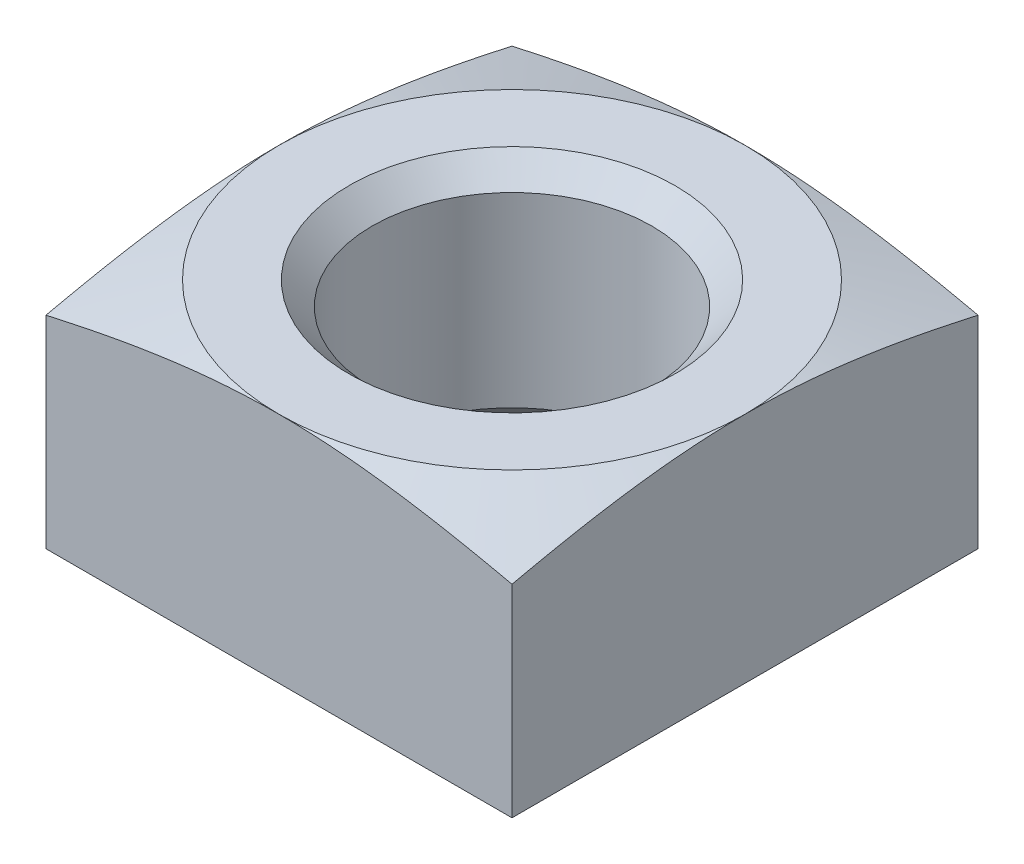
ISO-10303-21;
HEADER;
FILE_DESCRIPTION(('STEP AP214'),'2;1');
FILE_NAME('part.step','',(''),(''),'','','');
FILE_SCHEMA(('AUTOMOTIVE_DESIGN { 1 0 10303 214 1 1 1 1 }'));
ENDSEC;
DATA;
#1=APPLICATION_CONTEXT('core data for automotive mechanical design processes');
#2=APPLICATION_PROTOCOL_DEFINITION('international standard','automotive_design',2000,#1);
#3=PRODUCT_CONTEXT('',#1,'mechanical');
#4=PRODUCT('Part','Part','',(#3));
#5=PRODUCT_RELATED_PRODUCT_CATEGORY('part','',(#4));
#6=PRODUCT_DEFINITION_FORMATION('','',#4);
#7=PRODUCT_DEFINITION_CONTEXT('part definition',#1,'design');
#8=PRODUCT_DEFINITION('design','',#6,#7);
#9=PRODUCT_DEFINITION_SHAPE('','',#8);
#10=(LENGTH_UNIT() NAMED_UNIT(*) SI_UNIT(.MILLI.,.METRE.));
#11=(NAMED_UNIT(*) PLANE_ANGLE_UNIT() SI_UNIT($,.RADIAN.));
#12=(NAMED_UNIT(*) SI_UNIT($,.STERADIAN.) SOLID_ANGLE_UNIT());
#13=UNCERTAINTY_MEASURE_WITH_UNIT(LENGTH_MEASURE(1.E-05),#10,'distance_accuracy_value','');
#14=(GEOMETRIC_REPRESENTATION_CONTEXT(3) GLOBAL_UNCERTAINTY_ASSIGNED_CONTEXT((#13)) GLOBAL_UNIT_ASSIGNED_CONTEXT((#10,
#11,#12)) REPRESENTATION_CONTEXT('',''));
#15=CARTESIAN_POINT('',(0.,0.,0.));
#16=DIRECTION('',(0.,0.,1.));
#17=DIRECTION('',(1.,0.,0.));
#18=AXIS2_PLACEMENT_3D('',#15,#16,#17);
#19=CARTESIAN_POINT('',(5.,2.5,5.));
#20=DIRECTION('',(0.,0.,-1.));
#21=DIRECTION('',(-1.,0.,0.));
#22=AXIS2_PLACEMENT_3D('',#19,#20,#21);
#23=PLANE('',#22);
#24=DIRECTION('',(0.,-1.,0.));
#25=VECTOR('',#24,1.);
#26=CARTESIAN_POINT('',(5.,2.5,5.));
#27=LINE('',#26,#25);
#28=CARTESIAN_POINT('',(5.,1.8410238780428,5.));
#29=VERTEX_POINT('',#28);
#30=CARTESIAN_POINT('',(5.,-2.5,5.));
#31=VERTEX_POINT('',#30);
#32=EDGE_CURVE('E122',#29,#31,#27,.T.);
#33=ORIENTED_EDGE('',*,*,#32,.F.);
#34=CARTESIAN_POINT('',(-9.9547166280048,0.546409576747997,5.));
#35=CARTESIAN_POINT('',(-9.69691612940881,0.619697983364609,5.));
#36=CARTESIAN_POINT('',(-9.43896954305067,0.692477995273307,5.));
#37=CARTESIAN_POINT('',(-8.92270851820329,0.836743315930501,5.));
#38=CARTESIAN_POINT('',(-8.66439407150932,0.908228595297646,5.));
#39=CARTESIAN_POINT('',(-8.14742214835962,1.04959890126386,5.));
#40=CARTESIAN_POINT('',(-7.88876482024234,1.11948446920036,5.));
#41=CARTESIAN_POINT('',(-7.37092867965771,1.25729635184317,5.));
#42=CARTESIAN_POINT('',(-7.11174986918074,1.32522267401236,5.));
#43=CARTESIAN_POINT('',(-6.59474016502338,1.45810981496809,5.));
#44=CARTESIAN_POINT('',(-6.33691408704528,1.52308931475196,5.));
#45=CARTESIAN_POINT('',(-5.82051057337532,1.64998738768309,5.));
#46=CARTESIAN_POINT('',(-5.56193314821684,1.71190600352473,5.));
#47=CARTESIAN_POINT('',(-5.04364287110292,1.83189244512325,5.));
#48=CARTESIAN_POINT('',(-4.78392922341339,1.88995685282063,5.));
#49=CARTESIAN_POINT('',(-4.2634199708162,2.00106976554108,5.));
#50=CARTESIAN_POINT('',(-4.00262435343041,2.05411821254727,5.));
#51=CARTESIAN_POINT('',(-3.47502972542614,2.1546893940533,5.));
#52=CARTESIAN_POINT('',(-3.20820791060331,2.20209383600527,5.));
#53=CARTESIAN_POINT('',(-2.6731717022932,2.28839524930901,5.));
#54=CARTESIAN_POINT('',(-2.4049573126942,2.32729224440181,5.));
#55=CARTESIAN_POINT('',(-1.86768851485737,2.39444676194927,5.));
#56=CARTESIAN_POINT('',(-1.59863665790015,2.42272428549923,5.));
#57=CARTESIAN_POINT('',(-1.05950371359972,2.46678511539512,5.));
#58=CARTESIAN_POINT('',(-0.789422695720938,2.48256925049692,5.));
#59=CARTESIAN_POINT('',(-0.247248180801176,2.50037917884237,5.));
#60=CARTESIAN_POINT('',(0.0248479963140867,2.502325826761,5.));
#61=CARTESIAN_POINT('',(0.568770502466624,2.49207301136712,5.));
#62=CARTESIAN_POINT('',(0.840596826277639,2.4798732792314,5.));
#63=CARTESIAN_POINT('',(1.38381748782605,2.44235862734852,5.));
#64=CARTESIAN_POINT('',(1.6552101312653,2.41701980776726,5.));
#65=CARTESIAN_POINT('',(2.19668433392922,2.35509616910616,5.));
#66=CARTESIAN_POINT('',(2.46676586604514,2.31851111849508,5.));
#67=CARTESIAN_POINT('',(3.11363814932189,2.21971880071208,5.));
#68=CARTESIAN_POINT('',(3.48975036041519,2.15312127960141,5.));
#69=CARTESIAN_POINT('',(4.23953139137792,2.00722868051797,5.));
#70=CARTESIAN_POINT('',(4.61319959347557,1.92793051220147,5.));
#71=CARTESIAN_POINT('',(5.35881450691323,1.76040933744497,5.));
#72=CARTESIAN_POINT('',(5.73075964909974,1.67217942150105,5.));
#73=CARTESIAN_POINT('',(6.47306523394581,1.48948644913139,5.));
#74=CARTESIAN_POINT('',(6.8434258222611,1.39502397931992,5.));
#75=CARTESIAN_POINT('',(7.58394179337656,1.20137600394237,5.));
#76=CARTESIAN_POINT('',(7.95409409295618,1.10217876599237,5.));
#77=CARTESIAN_POINT('',(8.69350629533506,0.900497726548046,5.));
#78=CARTESIAN_POINT('',(9.06276618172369,0.798013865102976,5.));
#79=CARTESIAN_POINT('',(9.80041933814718,0.590642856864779,5.));
#80=CARTESIAN_POINT('',(10.1688129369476,0.485756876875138,5.));
#81=CARTESIAN_POINT('',(10.9050622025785,0.274111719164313,5.));
#82=CARTESIAN_POINT('',(11.272917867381,0.167352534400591,5.));
#83=CARTESIAN_POINT('',(12.3686425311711,-0.152973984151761,5.));
#84=CARTESIAN_POINT('',(13.0958968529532,-0.368642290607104,5.));
#85=CARTESIAN_POINT('',(14.5494426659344,-0.803569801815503,5.));
#86=CARTESIAN_POINT('',(15.2757340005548,-1.02282952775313,5.));
#87=CARTESIAN_POINT('',(16.7233709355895,-1.46247884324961,5.));
#88=CARTESIAN_POINT('',(17.4447207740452,-1.68285448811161,5.));
#89=CARTESIAN_POINT('',(18.5263018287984,-2.01465774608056,5.));
#90=CARTESIAN_POINT('',(18.8867262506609,-2.12545660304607,5.));
#91=CARTESIAN_POINT('',(19.6074636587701,-2.34741517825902,5.));
#92=CARTESIAN_POINT('',(19.9677766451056,-2.45857489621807,5.));
#93=CARTESIAN_POINT('',(20.3280428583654,-2.5698860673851,5.));
#94=B_SPLINE_CURVE_WITH_KNOTS('',3,(#34,#35,#36,#37,#38,#39,#40,#41,#42,#43,#44,#45,#46,#47,#48,
#49,#50,#51,#52,#53,#54,#55,#56,#57,#58,#59,#60,#61,#62,#63,#64,#65,#66,#67,#68,#69,#70,#71,#72,
#73,#74,#75,#76,#77,#78,#79,#80,#81,#82,#83,#84,#85,#86,#87,#88,#89,#90,#91,#92,#93),
.UNSPECIFIED.,.F.,.F.,(4,2,2,2,2,2,2,2,2,2,2,2,2,2,2,2,2,2,2,2,2,2,2,2,2,2,2,2,2,4),(0.,
0.804048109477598,1.60811444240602,2.41190453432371,3.21569156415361,4.01334208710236,
4.81098148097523,5.60931905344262,6.40766585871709,7.22055893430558,8.033449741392,
8.84480174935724,9.65609993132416,10.4720347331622,11.2879850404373,12.105424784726,
12.9228813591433,14.0684319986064,15.214261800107,16.3609848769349,17.5076001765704,
18.6572213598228,19.8068635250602,20.9559586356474,22.1050580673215,24.3807177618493,
26.6567106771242,28.9194931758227,30.0507045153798,31.1819149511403),.UNSPECIFIED.);
#95=CARTESIAN_POINT('',(0.,2.5,5.));
#96=VERTEX_POINT('',#95);
#97=EDGE_CURVE('E99',#29,#96,#94,.F.);
#98=ORIENTED_EDGE('',*,*,#97,.T.);
#99=CARTESIAN_POINT('',(-5.,1.8410238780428,5.));
#100=VERTEX_POINT('',#99);
#101=EDGE_CURVE('E112',#96,#100,#94,.F.);
#102=ORIENTED_EDGE('',*,*,#101,.T.);
#103=DIRECTION('',(0.,-1.,0.));
#104=VECTOR('',#103,1.);
#105=CARTESIAN_POINT('',(-5.,2.5,5.));
#106=LINE('',#105,#104);
#107=CARTESIAN_POINT('',(-5.,-2.5,5.));
#108=VERTEX_POINT('',#107);
#109=EDGE_CURVE('E184',#100,#108,#106,.T.);
#110=ORIENTED_EDGE('',*,*,#109,.T.);
#111=DIRECTION('',(-1.,0.,0.));
#112=VECTOR('',#111,1.);
#113=CARTESIAN_POINT('',(5.,-2.5,5.));
#114=LINE('',#113,#112);
#115=EDGE_CURVE('E193',#31,#108,#114,.T.);
#116=ORIENTED_EDGE('',*,*,#115,.F.);
#117=EDGE_LOOP('',(#33,#98,#102,#110,#116));
#118=FACE_BOUND('',#117,.T.);
#119=ADVANCED_FACE('F39',(#118),#23,.F.);
#120=CARTESIAN_POINT('',(5.,-2.5,-5.));
#121=DIRECTION('',(0.,1.,0.));
#122=DIRECTION('',(0.,0.,1.));
#123=AXIS2_PLACEMENT_3D('',#120,#121,#122);
#124=PLANE('',#123);
#125=CARTESIAN_POINT('',(0.,-2.5,0.));
#126=DIRECTION('',(0.,1.,0.));
#127=DIRECTION('',(0.,0.,1.));
#128=AXIS2_PLACEMENT_3D('',#125,#126,#127);
#129=CIRCLE('',#128,3.5);
#130=CARTESIAN_POINT('',(0.,-2.5,3.5));
#131=VERTEX_POINT('',#130);
#132=EDGE_CURVE('E11',#131,#131,#129,.T.);
#133=ORIENTED_EDGE('',*,*,#132,.T.);
#134=EDGE_LOOP('',(#133));
#135=FACE_BOUND('',#134,.T.);
#136=DIRECTION('',(0.,0.,-1.));
#137=VECTOR('',#136,1.);
#138=CARTESIAN_POINT('',(-5.,-2.5,-5.));
#139=LINE('',#138,#137);
#140=CARTESIAN_POINT('',(-5.,-2.5,-5.));
#141=VERTEX_POINT('',#140);
#142=EDGE_CURVE('E187',#108,#141,#139,.T.);
#143=ORIENTED_EDGE('',*,*,#142,.T.);
#144=DIRECTION('',(-1.,0.,0.));
#145=VECTOR('',#144,1.);
#146=CARTESIAN_POINT('',(5.,-2.5,-5.));
#147=LINE('',#146,#145);
#148=CARTESIAN_POINT('',(5.,-2.5,-5.));
#149=VERTEX_POINT('',#148);
#150=EDGE_CURVE('E183',#149,#141,#147,.T.);
#151=ORIENTED_EDGE('',*,*,#150,.F.);
#152=DIRECTION('',(0.,0.,-1.));
#153=VECTOR('',#152,1.);
#154=CARTESIAN_POINT('',(5.,-2.5,-5.));
#155=LINE('',#154,#153);
#156=EDGE_CURVE('E175',#31,#149,#155,.T.);
#157=ORIENTED_EDGE('',*,*,#156,.F.);
#158=ORIENTED_EDGE('',*,*,#115,.T.);
#159=EDGE_LOOP('',(#143,#151,#157,#158));
#160=FACE_BOUND('',#159,.T.);
#161=ADVANCED_FACE('F226',(#135,#160),#124,.F.);
#162=CARTESIAN_POINT('',(5.,2.5,-5.));
#163=DIRECTION('',(0.,0.,1.));
#164=DIRECTION('',(0.,-1.,0.));
#165=AXIS2_PLACEMENT_3D('',#162,#163,#164);
#166=PLANE('',#165);
#167=DIRECTION('',(0.,1.,0.));
#168=VECTOR('',#167,1.);
#169=CARTESIAN_POINT('',(-5.,2.5,-5.));
#170=LINE('',#169,#168);
#171=CARTESIAN_POINT('',(-5.,1.84102387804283,-5.00000000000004));
#172=VERTEX_POINT('',#171);
#173=EDGE_CURVE('E176',#141,#172,#170,.T.);
#174=ORIENTED_EDGE('',*,*,#173,.T.);
#175=CARTESIAN_POINT('',(-9.95471662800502,0.546409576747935,-5.));
#176=CARTESIAN_POINT('',(-9.69691612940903,0.619697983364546,-5.));
#177=CARTESIAN_POINT('',(-9.43896954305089,0.692477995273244,-5.));
#178=CARTESIAN_POINT('',(-8.92270851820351,0.836743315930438,-5.));
#179=CARTESIAN_POINT('',(-8.66439407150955,0.908228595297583,-5.));
#180=CARTESIAN_POINT('',(-8.14742214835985,1.04959890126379,-5.));
#181=CARTESIAN_POINT('',(-7.88876482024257,1.11948446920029,-5.));
#182=CARTESIAN_POINT('',(-7.37092867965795,1.2572963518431,-5.));
#183=CARTESIAN_POINT('',(-7.11174986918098,1.3252226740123,-5.));
#184=CARTESIAN_POINT('',(-6.59474016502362,1.45810981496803,-5.));
#185=CARTESIAN_POINT('',(-6.33691408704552,1.5230893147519,-5.));
#186=CARTESIAN_POINT('',(-5.82051057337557,1.64998738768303,-5.));
#187=CARTESIAN_POINT('',(-5.56193314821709,1.71190600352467,-5.));
#188=CARTESIAN_POINT('',(-5.04364287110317,1.83189244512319,-5.));
#189=CARTESIAN_POINT('',(-4.78392922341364,1.88995685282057,-5.));
#190=CARTESIAN_POINT('',(-4.26341997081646,2.00106976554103,-5.));
#191=CARTESIAN_POINT('',(-4.00262435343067,2.05411821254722,-5.));
#192=CARTESIAN_POINT('',(-3.4750297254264,2.15468939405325,-5.));
#193=CARTESIAN_POINT('',(-3.20820791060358,2.20209383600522,-5.));
#194=CARTESIAN_POINT('',(-2.67317170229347,2.28839524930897,-5.));
#195=CARTESIAN_POINT('',(-2.40495731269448,2.32729224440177,-5.));
#196=CARTESIAN_POINT('',(-1.86768851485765,2.39444676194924,-5.));
#197=CARTESIAN_POINT('',(-1.59863665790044,2.42272428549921,-5.));
#198=CARTESIAN_POINT('',(-1.05950371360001,2.4667851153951,-5.));
#199=CARTESIAN_POINT('',(-0.789422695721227,2.4825692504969,-5.));
#200=CARTESIAN_POINT('',(-0.24724818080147,2.50037917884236,-5.));
#201=CARTESIAN_POINT('',(0.0248479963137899,2.502325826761,-5.));
#202=CARTESIAN_POINT('',(0.568770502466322,2.49207301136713,-5.));
#203=CARTESIAN_POINT('',(0.840596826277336,2.47987327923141,-5.));
#204=CARTESIAN_POINT('',(1.38381748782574,2.44235862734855,-5.));
#205=CARTESIAN_POINT('',(1.65521013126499,2.41701980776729,-5.));
#206=CARTESIAN_POINT('',(2.1966843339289,2.3550961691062,-5.));
#207=CARTESIAN_POINT('',(2.46676586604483,2.31851111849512,-5.));
#208=CARTESIAN_POINT('',(3.11363814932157,2.21971880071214,-5.));
#209=CARTESIAN_POINT('',(3.48975036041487,2.15312127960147,-5.));
#210=CARTESIAN_POINT('',(4.2395313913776,2.00722868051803,-5.));
#211=CARTESIAN_POINT('',(4.61319959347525,1.92793051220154,-5.));
#212=CARTESIAN_POINT('',(5.35881450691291,1.76040933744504,-5.));
#213=CARTESIAN_POINT('',(5.73075964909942,1.67217942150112,-5.));
#214=CARTESIAN_POINT('',(6.47306523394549,1.48948644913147,-5.));
#215=CARTESIAN_POINT('',(6.84342582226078,1.39502397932,-5.));
#216=CARTESIAN_POINT('',(7.58394179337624,1.20137600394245,-5.));
#217=CARTESIAN_POINT('',(7.95409409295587,1.10217876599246,-5.));
#218=CARTESIAN_POINT('',(8.69350629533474,0.900497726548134,-5.));
#219=CARTESIAN_POINT('',(9.06276618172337,0.798013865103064,-5.));
#220=CARTESIAN_POINT('',(9.80041933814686,0.59064285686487,-5.));
#221=CARTESIAN_POINT('',(10.1688129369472,0.485756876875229,-5.));
#222=CARTESIAN_POINT('',(10.9050622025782,0.274111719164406,-5.));
#223=CARTESIAN_POINT('',(11.2729178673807,0.167352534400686,-5.));
#224=CARTESIAN_POINT('',(12.3686425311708,-0.152973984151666,-5.));
#225=CARTESIAN_POINT('',(13.0958968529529,-0.368642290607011,-5.));
#226=CARTESIAN_POINT('',(14.5494426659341,-0.803569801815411,-5.));
#227=CARTESIAN_POINT('',(15.2757340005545,-1.02282952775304,-5.));
#228=CARTESIAN_POINT('',(16.7233709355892,-1.46247884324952,-5.));
#229=CARTESIAN_POINT('',(17.4447207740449,-1.68285448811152,-5.));
#230=CARTESIAN_POINT('',(18.5263018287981,-2.01465774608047,-5.));
#231=CARTESIAN_POINT('',(18.8867262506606,-2.12545660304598,-5.));
#232=CARTESIAN_POINT('',(19.6074636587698,-2.34741517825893,-5.));
#233=CARTESIAN_POINT('',(19.9677766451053,-2.45857489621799,-5.));
#234=CARTESIAN_POINT('',(20.3280428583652,-2.56988606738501,-5.));
#235=B_SPLINE_CURVE_WITH_KNOTS('',3,(#175,#176,#177,#178,#179,#180,#181,#182,#183,#184,#185,
#186,#187,#188,#189,#190,#191,#192,#193,#194,#195,#196,#197,#198,#199,#200,#201,#202,#203,#204,
#205,#206,#207,#208,#209,#210,#211,#212,#213,#214,#215,#216,#217,#218,#219,#220,#221,#222,#223,
#224,#225,#226,#227,#228,#229,#230,#231,#232,#233,#234),.UNSPECIFIED.,.F.,.F.,(4,2,2,2,2,2,2,2,
2,2,2,2,2,2,2,2,2,2,2,2,2,2,2,2,2,2,2,2,2,4),(0.,0.804048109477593,1.60811444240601,
2.41190453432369,3.21569156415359,4.01334208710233,4.8109814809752,5.60931905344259,
6.40766585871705,7.22055893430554,8.03344974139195,8.84480174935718,9.65609993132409,
10.4720347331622,11.2879850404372,12.1054247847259,12.9228813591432,14.0684319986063,
15.2142618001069,16.3609848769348,17.5076001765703,18.6572213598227,19.8068635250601,
20.9559586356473,22.1050580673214,24.3807177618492,26.6567106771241,28.9194931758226,
30.0507045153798,31.1819149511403),.UNSPECIFIED.);
#236=CARTESIAN_POINT('',(0.,2.5,-5.));
#237=VERTEX_POINT('',#236);
#238=EDGE_CURVE('E62',#172,#237,#235,.T.);
#239=ORIENTED_EDGE('',*,*,#238,.T.);
#240=CARTESIAN_POINT('',(5.,1.84102387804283,-5.00000000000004));
#241=VERTEX_POINT('',#240);
#242=EDGE_CURVE('E137',#237,#241,#235,.T.);
#243=ORIENTED_EDGE('',*,*,#242,.T.);
#244=DIRECTION('',(0.,1.,0.));
#245=VECTOR('',#244,1.);
#246=CARTESIAN_POINT('',(5.,2.5,-5.));
#247=LINE('',#246,#245);
#248=EDGE_CURVE('E179',#149,#241,#247,.T.);
#249=ORIENTED_EDGE('',*,*,#248,.F.);
#250=ORIENTED_EDGE('',*,*,#150,.T.);
#251=EDGE_LOOP('',(#174,#239,#243,#249,#250));
#252=FACE_BOUND('',#251,.T.);
#253=ADVANCED_FACE('F143',(#252),#166,.F.);
#254=CARTESIAN_POINT('',(5.,0.,0.));
#255=DIRECTION('',(-1.,0.,0.));
#256=DIRECTION('',(0.,0.,1.));
#257=AXIS2_PLACEMENT_3D('',#254,#255,#256);
#258=PLANE('',#257);
#259=ORIENTED_EDGE('',*,*,#248,.T.);
#260=CARTESIAN_POINT('',(5.,0.546409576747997,-9.9547166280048));
#261=CARTESIAN_POINT('',(5.,0.619697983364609,-9.69691612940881));
#262=CARTESIAN_POINT('',(5.,0.692477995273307,-9.43896954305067));
#263=CARTESIAN_POINT('',(5.,0.836743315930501,-8.92270851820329));
#264=CARTESIAN_POINT('',(5.,0.908228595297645,-8.66439407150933));
#265=CARTESIAN_POINT('',(5.,1.04959890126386,-8.14742214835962));
#266=CARTESIAN_POINT('',(5.,1.11948446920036,-7.88876482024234));
#267=CARTESIAN_POINT('',(5.,1.25729635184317,-7.37092867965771));
#268=CARTESIAN_POINT('',(5.,1.32522267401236,-7.11174986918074));
#269=CARTESIAN_POINT('',(5.,1.45810981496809,-6.59474016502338));
#270=CARTESIAN_POINT('',(5.,1.52308931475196,-6.33691408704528));
#271=CARTESIAN_POINT('',(5.,1.64998738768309,-5.82051057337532));
#272=CARTESIAN_POINT('',(5.,1.71190600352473,-5.56193314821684));
#273=CARTESIAN_POINT('',(5.,1.83189244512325,-5.04364287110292));
#274=CARTESIAN_POINT('',(5.,1.88995685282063,-4.78392922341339));
#275=CARTESIAN_POINT('',(5.,2.00106976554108,-4.26341997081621));
#276=CARTESIAN_POINT('',(5.,2.05411821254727,-4.00262435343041));
#277=CARTESIAN_POINT('',(5.,2.1546893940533,-3.47502972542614));
#278=CARTESIAN_POINT('',(5.,2.20209383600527,-3.20820791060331));
#279=CARTESIAN_POINT('',(5.,2.28839524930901,-2.6731717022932));
#280=CARTESIAN_POINT('',(5.,2.32729224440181,-2.4049573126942));
#281=CARTESIAN_POINT('',(5.,2.39444676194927,-1.86768851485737));
#282=CARTESIAN_POINT('',(5.,2.42272428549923,-1.59863665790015));
#283=CARTESIAN_POINT('',(5.,2.46678511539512,-1.05950371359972));
#284=CARTESIAN_POINT('',(5.,2.48256925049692,-0.789422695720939));
#285=CARTESIAN_POINT('',(5.,2.50037917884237,-0.247248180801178));
#286=CARTESIAN_POINT('',(5.,2.502325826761,0.0248479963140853));
#287=CARTESIAN_POINT('',(5.,2.49207301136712,0.568770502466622));
#288=CARTESIAN_POINT('',(5.,2.4798732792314,0.840596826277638));
#289=CARTESIAN_POINT('',(5.,2.44235862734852,1.38381748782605));
#290=CARTESIAN_POINT('',(5.,2.41701980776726,1.6552101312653));
#291=CARTESIAN_POINT('',(5.,2.35509616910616,2.19668433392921));
#292=CARTESIAN_POINT('',(5.,2.31851111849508,2.46676586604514));
#293=CARTESIAN_POINT('',(5.,2.21971880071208,3.11363814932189));
#294=CARTESIAN_POINT('',(5.,2.15312127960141,3.48975036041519));
#295=CARTESIAN_POINT('',(5.,2.00722868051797,4.23953139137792));
#296=CARTESIAN_POINT('',(5.,1.92793051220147,4.61319959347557));
#297=CARTESIAN_POINT('',(5.,1.76040933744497,5.35881450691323));
#298=CARTESIAN_POINT('',(5.,1.67217942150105,5.73075964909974));
#299=CARTESIAN_POINT('',(5.,1.48948644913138,6.47306523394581));
#300=CARTESIAN_POINT('',(5.,1.39502397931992,6.84342582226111));
#301=CARTESIAN_POINT('',(5.,1.20137600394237,7.58394179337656));
#302=CARTESIAN_POINT('',(5.,1.10217876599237,7.95409409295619));
#303=CARTESIAN_POINT('',(5.,0.900497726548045,8.69350629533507));
#304=CARTESIAN_POINT('',(5.,0.798013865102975,9.06276618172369));
#305=CARTESIAN_POINT('',(5.,0.590642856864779,9.80041933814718));
#306=CARTESIAN_POINT('',(5.,0.485756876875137,10.1688129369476));
#307=CARTESIAN_POINT('',(5.,0.274111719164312,10.9050622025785));
#308=CARTESIAN_POINT('',(5.,0.167352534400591,11.272917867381));
#309=CARTESIAN_POINT('',(5.,-0.152973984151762,12.3686425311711));
#310=CARTESIAN_POINT('',(5.,-0.368642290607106,13.0958968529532));
#311=CARTESIAN_POINT('',(5.,-0.803569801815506,14.5494426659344));
#312=CARTESIAN_POINT('',(5.,-1.02282952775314,15.2757340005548));
#313=CARTESIAN_POINT('',(5.,-1.46247884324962,16.7233709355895));
#314=CARTESIAN_POINT('',(5.,-1.68285448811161,17.4447207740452));
#315=CARTESIAN_POINT('',(5.,-2.01465774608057,18.5263018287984));
#316=CARTESIAN_POINT('',(5.,-2.12545660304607,18.8867262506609));
#317=CARTESIAN_POINT('',(5.,-2.34741517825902,19.6074636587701));
#318=CARTESIAN_POINT('',(5.,-2.45857489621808,19.9677766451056));
#319=CARTESIAN_POINT('',(5.,-2.5698860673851,20.3280428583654));
#320=B_SPLINE_CURVE_WITH_KNOTS('',3,(#260,#261,#262,#263,#264,#265,#266,#267,#268,#269,#270,
#271,#272,#273,#274,#275,#276,#277,#278,#279,#280,#281,#282,#283,#284,#285,#286,#287,#288,#289,
#290,#291,#292,#293,#294,#295,#296,#297,#298,#299,#300,#301,#302,#303,#304,#305,#306,#307,#308,
#309,#310,#311,#312,#313,#314,#315,#316,#317,#318,#319),.UNSPECIFIED.,.F.,.F.,(4,2,2,2,2,2,2,2,
2,2,2,2,2,2,2,2,2,2,2,2,2,2,2,2,2,2,2,2,2,4),(0.,0.804048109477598,1.60811444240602,
2.41190453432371,3.21569156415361,4.01334208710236,4.81098148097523,5.60931905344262,
6.40766585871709,7.22055893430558,8.033449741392,8.84480174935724,9.65609993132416,
10.4720347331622,11.2879850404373,12.105424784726,12.9228813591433,14.0684319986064,
15.214261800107,16.3609848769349,17.5076001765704,18.6572213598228,19.8068635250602,
20.9559586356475,22.1050580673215,24.3807177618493,26.6567106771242,28.9194931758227,
30.0507045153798,31.1819149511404),.UNSPECIFIED.);
#321=CARTESIAN_POINT('',(5.,2.5,0.));
#322=VERTEX_POINT('',#321);
#323=EDGE_CURVE('E172',#241,#322,#320,.T.);
#324=ORIENTED_EDGE('',*,*,#323,.T.);
#325=EDGE_CURVE('E101',#322,#29,#320,.T.);
#326=ORIENTED_EDGE('',*,*,#325,.T.);
#327=ORIENTED_EDGE('',*,*,#32,.T.);
#328=ORIENTED_EDGE('',*,*,#156,.T.);
#329=EDGE_LOOP('',(#259,#324,#326,#327,#328));
#330=FACE_BOUND('',#329,.T.);
#331=ADVANCED_FACE('F155',(#330),#258,.F.);
#332=CARTESIAN_POINT('',(-5.,0.,0.));
#333=DIRECTION('',(-1.,0.,0.));
#334=DIRECTION('',(0.,0.,1.));
#335=AXIS2_PLACEMENT_3D('',#332,#333,#334);
#336=PLANE('',#335);
#337=CARTESIAN_POINT('',(-5.,0.546409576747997,-9.9547166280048));
#338=CARTESIAN_POINT('',(-5.,0.619697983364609,-9.69691612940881));
#339=CARTESIAN_POINT('',(-5.,0.692477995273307,-9.43896954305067));
#340=CARTESIAN_POINT('',(-5.,0.836743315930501,-8.92270851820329));
#341=CARTESIAN_POINT('',(-5.,0.908228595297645,-8.66439407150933));
#342=CARTESIAN_POINT('',(-5.,1.04959890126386,-8.14742214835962));
#343=CARTESIAN_POINT('',(-5.,1.11948446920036,-7.88876482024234));
#344=CARTESIAN_POINT('',(-5.,1.25729635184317,-7.37092867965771));
#345=CARTESIAN_POINT('',(-5.,1.32522267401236,-7.11174986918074));
#346=CARTESIAN_POINT('',(-5.,1.45810981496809,-6.59474016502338));
#347=CARTESIAN_POINT('',(-5.,1.52308931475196,-6.33691408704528));
#348=CARTESIAN_POINT('',(-5.,1.64998738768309,-5.82051057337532));
#349=CARTESIAN_POINT('',(-5.,1.71190600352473,-5.56193314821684));
#350=CARTESIAN_POINT('',(-5.,1.83189244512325,-5.04364287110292));
#351=CARTESIAN_POINT('',(-5.,1.88995685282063,-4.78392922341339));
#352=CARTESIAN_POINT('',(-5.,2.00106976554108,-4.26341997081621));
#353=CARTESIAN_POINT('',(-5.,2.05411821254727,-4.00262435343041));
#354=CARTESIAN_POINT('',(-5.,2.1546893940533,-3.47502972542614));
#355=CARTESIAN_POINT('',(-5.,2.20209383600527,-3.20820791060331));
#356=CARTESIAN_POINT('',(-5.,2.28839524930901,-2.6731717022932));
#357=CARTESIAN_POINT('',(-5.,2.32729224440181,-2.4049573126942));
#358=CARTESIAN_POINT('',(-5.,2.39444676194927,-1.86768851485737));
#359=CARTESIAN_POINT('',(-5.,2.42272428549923,-1.59863665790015));
#360=CARTESIAN_POINT('',(-5.,2.46678511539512,-1.05950371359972));
#361=CARTESIAN_POINT('',(-5.,2.48256925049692,-0.789422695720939));
#362=CARTESIAN_POINT('',(-5.,2.50037917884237,-0.247248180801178));
#363=CARTESIAN_POINT('',(-5.,2.502325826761,0.0248479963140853));
#364=CARTESIAN_POINT('',(-5.,2.49207301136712,0.568770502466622));
#365=CARTESIAN_POINT('',(-5.,2.4798732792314,0.840596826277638));
#366=CARTESIAN_POINT('',(-5.,2.44235862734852,1.38381748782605));
#367=CARTESIAN_POINT('',(-5.,2.41701980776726,1.6552101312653));
#368=CARTESIAN_POINT('',(-5.,2.35509616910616,2.19668433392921));
#369=CARTESIAN_POINT('',(-5.,2.31851111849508,2.46676586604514));
#370=CARTESIAN_POINT('',(-5.,2.21971880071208,3.11363814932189));
#371=CARTESIAN_POINT('',(-5.,2.15312127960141,3.48975036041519));
#372=CARTESIAN_POINT('',(-5.,2.00722868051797,4.23953139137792));
#373=CARTESIAN_POINT('',(-5.,1.92793051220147,4.61319959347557));
#374=CARTESIAN_POINT('',(-5.,1.76040933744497,5.35881450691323));
#375=CARTESIAN_POINT('',(-5.,1.67217942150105,5.73075964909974));
#376=CARTESIAN_POINT('',(-5.,1.48948644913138,6.47306523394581));
#377=CARTESIAN_POINT('',(-5.,1.39502397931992,6.84342582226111));
#378=CARTESIAN_POINT('',(-5.,1.20137600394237,7.58394179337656));
#379=CARTESIAN_POINT('',(-5.,1.10217876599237,7.95409409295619));
#380=CARTESIAN_POINT('',(-5.,0.900497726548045,8.69350629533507));
#381=CARTESIAN_POINT('',(-5.,0.798013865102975,9.06276618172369));
#382=CARTESIAN_POINT('',(-5.,0.590642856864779,9.80041933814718));
#383=CARTESIAN_POINT('',(-5.,0.485756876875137,10.1688129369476));
#384=CARTESIAN_POINT('',(-5.,0.274111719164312,10.9050622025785));
#385=CARTESIAN_POINT('',(-5.,0.167352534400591,11.272917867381));
#386=CARTESIAN_POINT('',(-5.,-0.152973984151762,12.3686425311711));
#387=CARTESIAN_POINT('',(-5.,-0.368642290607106,13.0958968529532));
#388=CARTESIAN_POINT('',(-5.,-0.803569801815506,14.5494426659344));
#389=CARTESIAN_POINT('',(-5.,-1.02282952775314,15.2757340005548));
#390=CARTESIAN_POINT('',(-5.,-1.46247884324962,16.7233709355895));
#391=CARTESIAN_POINT('',(-5.,-1.68285448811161,17.4447207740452));
#392=CARTESIAN_POINT('',(-5.,-2.01465774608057,18.5263018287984));
#393=CARTESIAN_POINT('',(-5.,-2.12545660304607,18.8867262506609));
#394=CARTESIAN_POINT('',(-5.,-2.34741517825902,19.6074636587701));
#395=CARTESIAN_POINT('',(-5.,-2.45857489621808,19.9677766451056));
#396=CARTESIAN_POINT('',(-5.,-2.5698860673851,20.3280428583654));
#397=B_SPLINE_CURVE_WITH_KNOTS('',3,(#337,#338,#339,#340,#341,#342,#343,#344,#345,#346,#347,
#348,#349,#350,#351,#352,#353,#354,#355,#356,#357,#358,#359,#360,#361,#362,#363,#364,#365,#366,
#367,#368,#369,#370,#371,#372,#373,#374,#375,#376,#377,#378,#379,#380,#381,#382,#383,#384,#385,
#386,#387,#388,#389,#390,#391,#392,#393,#394,#395,#396),.UNSPECIFIED.,.F.,.F.,(4,2,2,2,2,2,2,2,
2,2,2,2,2,2,2,2,2,2,2,2,2,2,2,2,2,2,2,2,2,4),(0.,0.804048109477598,1.60811444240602,
2.41190453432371,3.21569156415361,4.01334208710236,4.81098148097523,5.60931905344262,
6.40766585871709,7.22055893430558,8.033449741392,8.84480174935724,9.65609993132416,
10.4720347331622,11.2879850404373,12.105424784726,12.9228813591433,14.0684319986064,
15.214261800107,16.3609848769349,17.5076001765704,18.6572213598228,19.8068635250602,
20.9559586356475,22.1050580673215,24.3807177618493,26.6567106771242,28.9194931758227,
30.0507045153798,31.1819149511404),.UNSPECIFIED.);
#398=CARTESIAN_POINT('',(-5.,2.5,0.));
#399=VERTEX_POINT('',#398);
#400=EDGE_CURVE('E55',#172,#399,#397,.T.);
#401=ORIENTED_EDGE('',*,*,#400,.F.);
#402=ORIENTED_EDGE('',*,*,#173,.F.);
#403=ORIENTED_EDGE('',*,*,#142,.F.);
#404=ORIENTED_EDGE('',*,*,#109,.F.);
#405=EDGE_CURVE('E115',#399,#100,#397,.T.);
#406=ORIENTED_EDGE('',*,*,#405,.F.);
#407=EDGE_LOOP('',(#401,#402,#403,#404,#406));
#408=FACE_BOUND('',#407,.T.);
#409=ADVANCED_FACE('F241',(#408),#336,.T.);
#410=CARTESIAN_POINT('',(0.,1.8,0.));
#411=DIRECTION('',(0.,-1.,0.));
#412=DIRECTION('',(0.,0.,-1.));
#413=AXIS2_PLACEMENT_3D('',#410,#411,#412);
#414=CONICAL_SURFACE('',#413,7.2,1.26274354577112);
#415=CARTESIAN_POINT('',(0.,2.5,0.));
#416=DIRECTION('',(0.,1.,0.));
#417=DIRECTION('',(0.,0.,1.));
#418=AXIS2_PLACEMENT_3D('',#415,#416,#417);
#419=CIRCLE('',#418,5.);
#420=EDGE_CURVE('E109',#399,#96,#419,.T.);
#421=ORIENTED_EDGE('',*,*,#420,.F.);
#422=ORIENTED_EDGE('',*,*,#405,.T.);
#423=ORIENTED_EDGE('',*,*,#101,.F.);
#424=EDGE_LOOP('',(#421,#422,#423));
#425=FACE_BOUND('',#424,.T.);
#426=ADVANCED_FACE('F113',(#425),#414,.T.);
#427=ORIENTED_EDGE('',*,*,#400,.T.);
#428=EDGE_CURVE('E126',#237,#399,#419,.T.);
#429=ORIENTED_EDGE('',*,*,#428,.F.);
#430=ORIENTED_EDGE('',*,*,#238,.F.);
#431=EDGE_LOOP('',(#427,#429,#430));
#432=FACE_BOUND('',#431,.T.);
#433=ADVANCED_FACE('F153',(#432),#414,.T.);
#434=EDGE_CURVE('E95',#96,#322,#419,.T.);
#435=ORIENTED_EDGE('',*,*,#434,.F.);
#436=ORIENTED_EDGE('',*,*,#97,.F.);
#437=ORIENTED_EDGE('',*,*,#325,.F.);
#438=EDGE_LOOP('',(#435,#436,#437));
#439=FACE_BOUND('',#438,.T.);
#440=ADVANCED_FACE('F97',(#439),#414,.T.);
#441=EDGE_CURVE('E107',#322,#237,#419,.T.);
#442=ORIENTED_EDGE('',*,*,#441,.F.);
#443=ORIENTED_EDGE('',*,*,#323,.F.);
#444=ORIENTED_EDGE('',*,*,#242,.F.);
#445=EDGE_LOOP('',(#442,#443,#444));
#446=FACE_BOUND('',#445,.T.);
#447=ADVANCED_FACE('F147',(#446),#414,.T.);
#448=CARTESIAN_POINT('',(5.,2.5,-5.));
#449=DIRECTION('',(0.,-1.,0.));
#450=DIRECTION('',(0.,0.,-1.));
#451=AXIS2_PLACEMENT_3D('',#448,#449,#450);
#452=PLANE('',#451);
#453=CARTESIAN_POINT('',(0.,2.5,0.));
#454=DIRECTION('',(0.,-1.,0.));
#455=DIRECTION('',(0.,0.,-1.));
#456=AXIS2_PLACEMENT_3D('',#453,#454,#455);
#457=CIRCLE('',#456,3.5);
#458=CARTESIAN_POINT('',(0.,2.5,-3.5));
#459=VERTEX_POINT('',#458);
#460=EDGE_CURVE('E48',#459,#459,#457,.T.);
#461=ORIENTED_EDGE('',*,*,#460,.T.);
#462=EDGE_LOOP('',(#461));
#463=FACE_BOUND('',#462,.T.);
#464=ORIENTED_EDGE('',*,*,#441,.T.);
#465=ORIENTED_EDGE('',*,*,#428,.T.);
#466=ORIENTED_EDGE('',*,*,#420,.T.);
#467=ORIENTED_EDGE('',*,*,#434,.T.);
#468=EDGE_LOOP('',(#464,#465,#466,#467));
#469=FACE_BOUND('',#468,.T.);
#470=ADVANCED_FACE('F125',(#463,#469),#452,.F.);
#471=CARTESIAN_POINT('',(0.,-10.9852813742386,0.));
#472=DIRECTION('',(0.,1.,0.));
#473=DIRECTION('',(0.,0.,1.));
#474=AXIS2_PLACEMENT_3D('',#471,#472,#473);
#475=CYLINDRICAL_SURFACE('',#474,3.);
#476=CARTESIAN_POINT('',(0.,2.,0.));
#477=DIRECTION('',(0.,-1.,0.));
#478=DIRECTION('',(0.,0.,-1.));
#479=AXIS2_PLACEMENT_3D('',#476,#477,#478);
#480=CIRCLE('',#479,3.);
#481=CARTESIAN_POINT('',(0.,2.,-3.));
#482=VERTEX_POINT('',#481);
#483=EDGE_CURVE('E205',#482,#482,#480,.F.);
#484=ORIENTED_EDGE('',*,*,#483,.T.);
#485=EDGE_LOOP('',(#484));
#486=FACE_BOUND('',#485,.T.);
#487=CARTESIAN_POINT('',(0.,-2.,0.));
#488=DIRECTION('',(0.,1.,0.));
#489=DIRECTION('',(0.,0.,1.));
#490=AXIS2_PLACEMENT_3D('',#487,#488,#489);
#491=CIRCLE('',#490,3.);
#492=CARTESIAN_POINT('',(0.,-2.,3.));
#493=VERTEX_POINT('',#492);
#494=EDGE_CURVE('E201',#493,#493,#491,.F.);
#495=ORIENTED_EDGE('',*,*,#494,.T.);
#496=EDGE_LOOP('',(#495));
#497=FACE_BOUND('',#496,.T.);
#498=ADVANCED_FACE('F154',(#486,#497),#475,.F.);
#499=CARTESIAN_POINT('',(0.,2.,0.));
#500=DIRECTION('',(0.,1.,0.));
#501=DIRECTION('',(0.,0.,1.));
#502=AXIS2_PLACEMENT_3D('',#499,#500,#501);
#503=CONICAL_SURFACE('',#502,3.,0.78539816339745);
#504=ORIENTED_EDGE('',*,*,#460,.F.);
#505=EDGE_LOOP('',(#504));
#506=FACE_BOUND('',#505,.T.);
#507=ORIENTED_EDGE('',*,*,#483,.F.);
#508=EDGE_LOOP('',(#507));
#509=FACE_BOUND('',#508,.T.);
#510=ADVANCED_FACE('F216',(#506,#509),#503,.F.);
#511=CARTESIAN_POINT('',(0.,-2.,0.));
#512=DIRECTION('',(0.,-1.,0.));
#513=DIRECTION('',(0.,0.,-1.));
#514=AXIS2_PLACEMENT_3D('',#511,#512,#513);
#515=CONICAL_SURFACE('',#514,3.,0.78539816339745);
#516=ORIENTED_EDGE('',*,*,#132,.F.);
#517=EDGE_LOOP('',(#516));
#518=FACE_BOUND('',#517,.T.);
#519=ORIENTED_EDGE('',*,*,#494,.F.);
#520=EDGE_LOOP('',(#519));
#521=FACE_BOUND('',#520,.T.);
#522=ADVANCED_FACE('F41',(#518,#521),#515,.F.);
#523=CLOSED_SHELL('',(#119,#161,#253,#331,#409,#426,#433,#440,#447,#470,#498,#510,#522));
#524=MANIFOLD_SOLID_BREP('B2',#523);
#525=ADVANCED_BREP_SHAPE_REPRESENTATION('',(#18,#524),#14);
#526=SHAPE_DEFINITION_REPRESENTATION(#9,#525);
ENDSEC;
END-ISO-10303-21;
